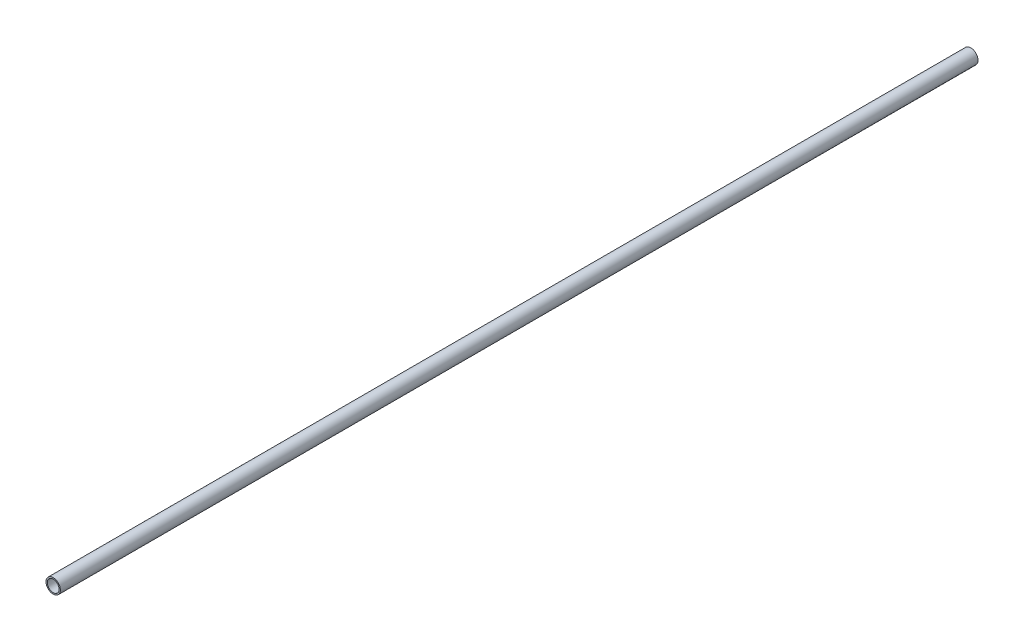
from build123d import *

# Parameters (mm, degrees)
ESQUISSE1_R        = 2.2
ESQUISSE1_R_2      = 1.8
BOSS_EXTRU_1_DEPTH = 280


with BuildPart() as part:
    # Esquisse1 → Boss.-Extru.1 (new body)
    with BuildSketch(Plane.XY):
        Circle(ESQUISSE1_R)
        Circle(ESQUISSE1_R_2, mode=Mode.SUBTRACT)
    extrude(amount=BOSS_EXTRU_1_DEPTH)


solid = part.part
